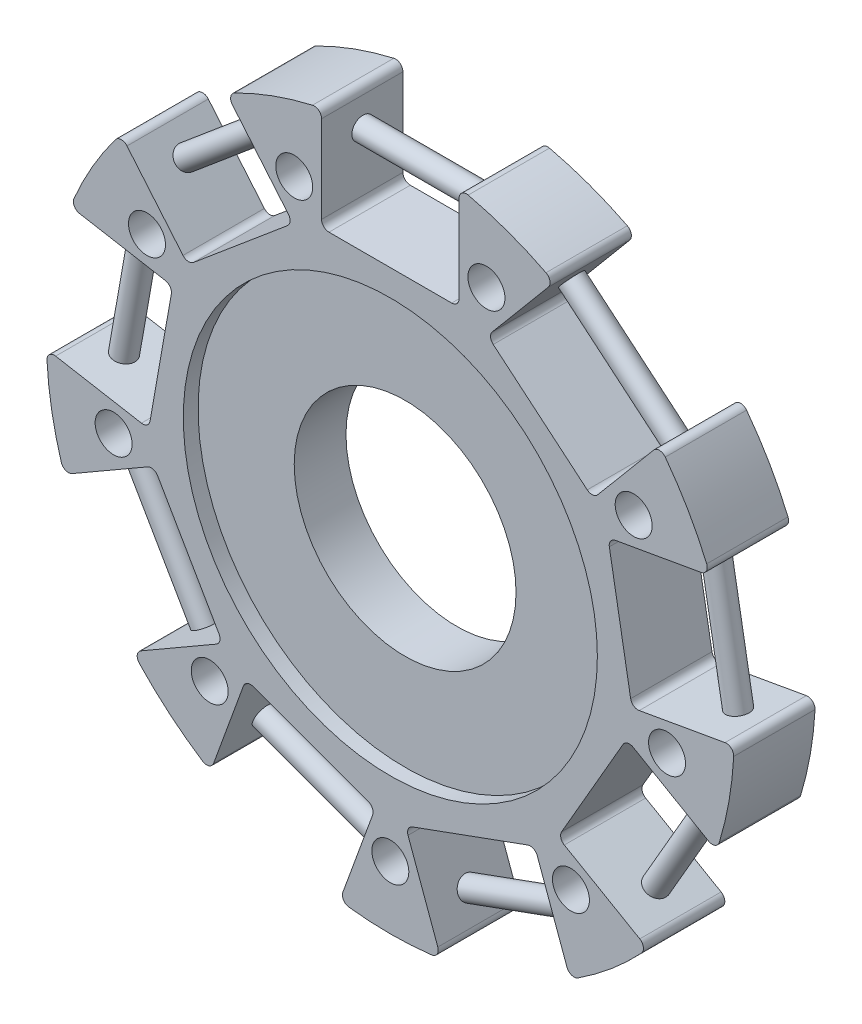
from build123d import *

# Parameters (mm, degrees)
BOSS_EXTRUDE1_DEPTH = 11
SKETCH3_R           = 2.5
CUT_EXTRUDE4_DEPTH  = 11
SKETCH7_R           = 28
CUT_EXTRUDE5_DEPTH  = 2
CUT_EXTRUDE6_START  = -2
SKETCH10_R          = 28
CUT_EXTRUDE6_DEPTH  = 2
SKETCH12_R          = 15
CUT_EXTRUDE7_DEPTH  = 67.332794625
SKETCH13_R          = 1.5
BOSS_EXTRUDE2_DEPTH = 18.5
CIRPATTERN1_COUNT   = 9


with BuildPart() as part:
    # Sketch1 → Boss-Extrude1 (new body)
    with BuildSketch(Plane.XY):
        with BuildLine():
            Line((8.3, 31.537634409), (-8.3, 31.537634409))
            ThreePointArc((-8.3, 31.537634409), (-9.007106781, 31.830527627), (-9.3, 32.537634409))
            Line((-9.3, 32.537634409), (-9.3, 44.322482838))
            ThreePointArc((-9.3, 44.322482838), (-9.67804984, 45.105539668), (-10.526355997, 45.296527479))
            ThreePointArc((-10.526355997, 45.296527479), (-15.905148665, 43.699036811), (-21.052390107, 41.465364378))
            ThreePointArc((-21.052390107, 41.465364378), (-21.579465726, 40.773778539), (-21.365729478, 39.930916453))
            Line((-21.365729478, 39.930916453), (-13.790574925, 30.903198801))
            ThreePointArc((-13.790574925, 30.903198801), (-13.56042467, 30.173255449), (-13.913831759, 29.494366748))
            Line((-13.913831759, 29.494366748), (-26.630169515, 18.824092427))
            ThreePointArc((-26.630169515, 18.824092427), (-27.360112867, 18.593942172), (-28.039001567, 18.947349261))
            Line((-28.039001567, 18.947349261), (-35.61415612, 27.975066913))
            ThreePointArc((-35.61415612, 27.975066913), (-36.407098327, 28.331917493), (-37.179703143, 27.932941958))
            ThreePointArc((-37.179703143, 27.932941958), (-40.273250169, 23.251771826), (-42.780488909, 18.232096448))
            ThreePointArc((-42.780488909, 18.232096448), (-42.73970945, 17.363513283), (-42.034196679, 16.855230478))
            Line((-42.034196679, 16.855230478), (-30.428386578, 14.808813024))
            ThreePointArc((-30.428386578, 14.808813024), (-29.782882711, 14.397581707), (-29.617227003, 13.650357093))
            Line((-29.617227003, 13.650357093), (-32.499786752, -2.697451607))
            ThreePointArc((-32.499786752, -2.697451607), (-32.911018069, -3.342955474), (-33.658242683, -3.508611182))
            Line((-33.658242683, -3.508611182), (-45.264052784, -1.462193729))
            ThreePointArc((-45.264052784, -1.462193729), (-46.100860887, -1.698523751), (-46.436253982, -2.500777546))
            ThreePointArc((-46.436253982, -2.500777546), (-45.797050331, -8.07525561), (-44.491121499, -13.532172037))
            ThreePointArc((-44.491121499, -13.532172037), (-43.901568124, -14.171332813), (-43.034396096, -14.107205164))
            Line((-43.034396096, -14.107205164), (-32.828417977, -8.214780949))
            ThreePointArc((-32.828417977, -8.214780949), (-32.069598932, -8.114880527), (-31.462392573, -8.580806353))
            Line((-31.462392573, -8.580806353), (-23.162392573, -22.956828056))
            ThreePointArc((-23.162392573, -22.956828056), (-23.062492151, -23.715647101), (-23.528417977, -24.322853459))
            Line((-23.528417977, -24.322853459), (-33.734396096, -30.215277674))
            ThreePointArc((-33.734396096, -30.215277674), (-34.223518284, -30.934206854), (-33.964765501, -31.764355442))
            ThreePointArc((-33.964765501, -31.764355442), (-29.891901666, -35.6237812), (-25.383863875, -38.964586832))
            ThreePointArc((-25.383863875, -38.964586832), (-24.52139516, -39.075254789), (-23.898323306, -38.468722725))
            Line((-23.898323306, -38.468722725), (-19.867667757, -27.394587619))
            ThreePointArc((-19.867667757, -27.394587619), (-19.350593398, -26.830299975), (-18.585954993, -26.796915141))
            Line((-18.585954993, -26.796915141), (-2.987057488, -32.47444952))
            ThreePointArc((-2.987057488, -32.47444952), (-2.422769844, -32.991523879), (-2.389385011, -33.756162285))
            Line((-2.389385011, -33.756162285), (-6.420040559, -44.830297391))
            ThreePointArc((-6.420040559, -44.830297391), (-6.332611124, -45.695430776), (-5.600785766, -46.165038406))
            ThreePointArc((-5.600785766, -46.165038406), (0, -46.503543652), (5.600785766, -46.165038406))
            ThreePointArc((5.600785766, -46.165038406), (6.332611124, -45.695430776), (6.420040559, -44.830297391))
            Line((6.420040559, -44.830297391), (2.389385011, -33.756162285))
            ThreePointArc((2.389385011, -33.756162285), (2.422769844, -32.991523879), (2.987057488, -32.47444952))
            Line((2.987057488, -32.47444952), (18.585954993, -26.796915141))
            ThreePointArc((18.585954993, -26.796915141), (19.350593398, -26.830299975), (19.867667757, -27.394587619))
            Line((19.867667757, -27.394587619), (23.898323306, -38.468722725))
            ThreePointArc((23.898323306, -38.468722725), (24.52139516, -39.075254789), (25.383863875, -38.964586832))
            ThreePointArc((25.383863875, -38.964586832), (29.891901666, -35.6237812), (33.964765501, -31.764355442))
            ThreePointArc((33.964765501, -31.764355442), (34.223518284, -30.934206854), (33.734396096, -30.215277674))
            Line((33.734396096, -30.215277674), (23.528417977, -24.322853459))
            ThreePointArc((23.528417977, -24.322853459), (23.062492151, -23.715647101), (23.162392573, -22.956828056))
            Line((23.162392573, -22.956828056), (31.462392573, -8.580806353))
            ThreePointArc((31.462392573, -8.580806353), (32.069598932, -8.114880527), (32.828417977, -8.214780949))
            Line((32.828417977, -8.214780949), (43.034396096, -14.107205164))
            ThreePointArc((43.034396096, -14.107205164), (43.901568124, -14.171332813), (44.491121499, -13.532172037))
            ThreePointArc((44.491121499, -13.532172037), (45.797050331, -8.07525561), (46.436253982, -2.500777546))
            ThreePointArc((46.436253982, -2.500777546), (46.100860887, -1.698523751), (45.264052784, -1.462193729))
            Line((45.264052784, -1.462193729), (33.658242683, -3.508611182))
            ThreePointArc((33.658242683, -3.508611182), (32.911018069, -3.342955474), (32.499786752, -2.697451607))
            Line((32.499786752, -2.697451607), (29.617227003, 13.650357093))
            ThreePointArc((29.617227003, 13.650357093), (29.782882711, 14.397581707), (30.428386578, 14.808813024))
            Line((30.428386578, 14.808813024), (42.034196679, 16.855230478))
            ThreePointArc((42.034196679, 16.855230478), (42.73970945, 17.363513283), (42.780488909, 18.232096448))
            ThreePointArc((42.780488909, 18.232096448), (40.273250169, 23.251771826), (37.179703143, 27.932941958))
            ThreePointArc((37.179703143, 27.932941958), (36.407098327, 28.331917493), (35.61415612, 27.975066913))
            Line((35.61415612, 27.975066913), (28.039001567, 18.947349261))
            ThreePointArc((28.039001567, 18.947349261), (27.360112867, 18.593942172), (26.630169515, 18.824092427))
            Line((26.630169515, 18.824092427), (13.913831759, 29.494366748))
            ThreePointArc((13.913831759, 29.494366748), (13.56042467, 30.173255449), (13.790574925, 30.903198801))
            Line((13.790574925, 30.903198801), (21.365729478, 39.930916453))
            ThreePointArc((21.365729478, 39.930916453), (21.579465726, 40.773778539), (21.052390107, 41.465364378))
            ThreePointArc((21.052390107, 41.465364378), (15.905148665, 43.699036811), (10.526355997, 45.296527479))
            ThreePointArc((10.526355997, 45.296527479), (9.67804984, 45.105539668), (9.3, 44.322482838))
            Line((9.3, 44.322482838), (9.3, 32.537634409))
            ThreePointArc((9.3, 32.537634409), (9.007106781, 31.830527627), (8.3, 31.537634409))
        make_face()
    extrude(amount=BOSS_EXTRUDE1_DEPTH)

    # Sketch3 → Cut-Extrude4 (cut)
    with BuildSketch(Plane.XY.offset(11)):
        with Locations((12.996765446, 35.70831959)):
            Circle(SKETCH3_R)
        with Locations((-12.996765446, 35.70831959)):
            Circle(SKETCH3_R)
        with Locations((32.908965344, 19)):
            Circle(SKETCH3_R)
        with Locations((37.422694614, -6.598630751)):
            Circle(SKETCH3_R)
        with Locations((24.425929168, -29.109688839)):
            Circle(SKETCH3_R)
        with Locations((0, -38)):
            Circle(SKETCH3_R)
        with Locations((-24.425929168, -29.109688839)):
            Circle(SKETCH3_R)
        with Locations((-37.422694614, -6.598630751)):
            Circle(SKETCH3_R)
        with Locations((-32.908965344, 19)):
            Circle(SKETCH3_R)
    extrude(amount=-CUT_EXTRUDE4_DEPTH, mode=Mode.SUBTRACT)

    # Sketch7 → Cut-Extrude5 (cut)
    with BuildSketch(Plane.XY.offset(11)):
        Circle(SKETCH7_R)
    extrude(amount=-CUT_EXTRUDE5_DEPTH, mode=Mode.SUBTRACT)

    # Sketch10 → Cut-Extrude6 (cut)
    with BuildSketch(Plane(origin=(0, 0, 0), x_dir=(-1, 0, 0), z_dir=(0, 0, -1)).offset(CUT_EXTRUDE6_START)):
        with Locations(Location((0, 0, 0), (0, 0, 180))):
            Circle(SKETCH10_R)
    extrude(amount=CUT_EXTRUDE6_DEPTH, mode=Mode.SUBTRACT)

    # Sketch12 → Cut-Extrude7 (cut, through all)
    with BuildSketch(Plane(origin=(0, 0, 2), x_dir=(-1, 0, 0), z_dir=(0, 0, -1))):
        Circle(SKETCH12_R)
    extrude(amount=-CUT_EXTRUDE7_DEPTH, mode=Mode.SUBTRACT)

    # Sketch13 → Boss-Extrude2 (add)
    with BuildSketch(Plane(origin=(7.124213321, -5.97792477, 0), x_dir=(0, 0, 1), z_dir=(-0.7660444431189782, 0.6427876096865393, 0))):
        with Locations(Location((5.5, 40.537634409, 0), (0, 0, 90))):
            Circle(SKETCH13_R)
    boss_extrude2 = extrude(amount=BOSS_EXTRUDE2_DEPTH)

    # CirPattern1: Boss-Extrude2 ×9 about axis
    cirpattern1_axis = Axis((0, 0, 0), (0, 0, 1))
    for i in range(1, CIRPATTERN1_COUNT):
        add(boss_extrude2.rotate(cirpattern1_axis, i * 360 / CIRPATTERN1_COUNT))


solid = part.part
